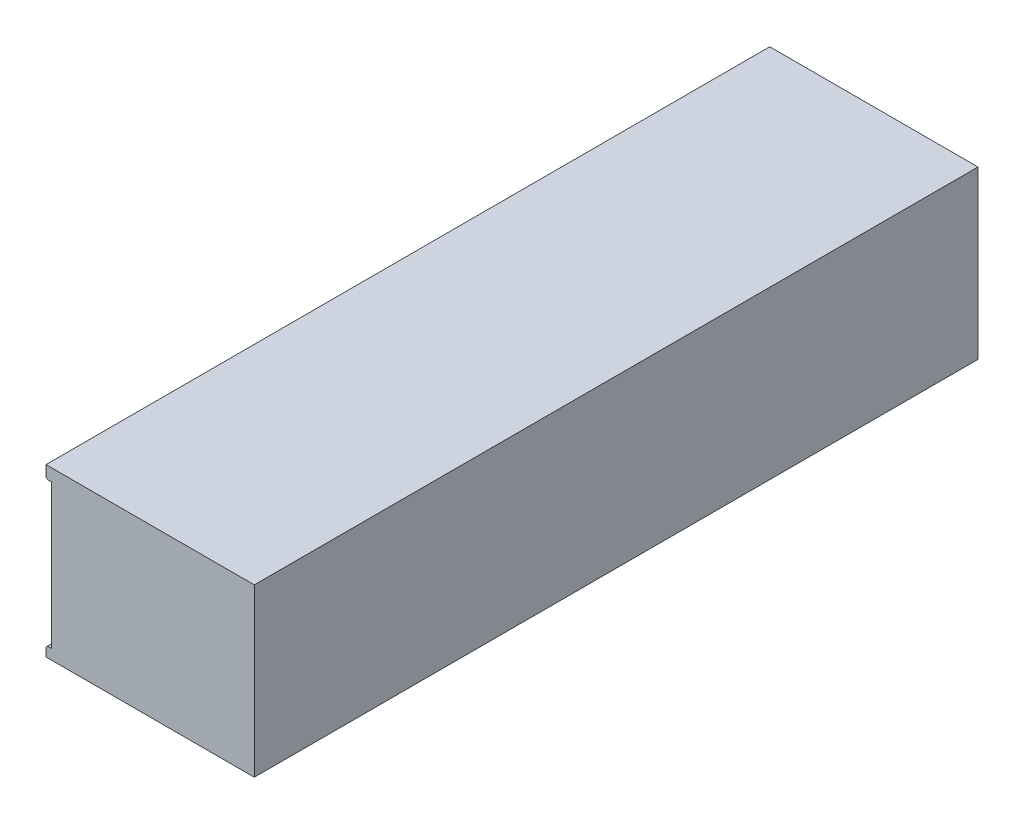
ISO-10303-21;
HEADER;
FILE_DESCRIPTION(('STEP AP214'),'2;1');
FILE_NAME('part.step','',(''),(''),'','','');
FILE_SCHEMA(('AUTOMOTIVE_DESIGN { 1 0 10303 214 1 1 1 1 }'));
ENDSEC;
DATA;
#1=APPLICATION_CONTEXT('core data for automotive mechanical design processes');
#2=APPLICATION_PROTOCOL_DEFINITION('international standard','automotive_design',2000,#1);
#3=PRODUCT_CONTEXT('',#1,'mechanical');
#4=PRODUCT('Part','Part','',(#3));
#5=PRODUCT_RELATED_PRODUCT_CATEGORY('part','',(#4));
#6=PRODUCT_DEFINITION_FORMATION('','',#4);
#7=PRODUCT_DEFINITION_CONTEXT('part definition',#1,'design');
#8=PRODUCT_DEFINITION('design','',#6,#7);
#9=PRODUCT_DEFINITION_SHAPE('','',#8);
#10=(LENGTH_UNIT() NAMED_UNIT(*) SI_UNIT(.MILLI.,.METRE.));
#11=(NAMED_UNIT(*) PLANE_ANGLE_UNIT() SI_UNIT($,.RADIAN.));
#12=(NAMED_UNIT(*) SI_UNIT($,.STERADIAN.) SOLID_ANGLE_UNIT());
#13=UNCERTAINTY_MEASURE_WITH_UNIT(LENGTH_MEASURE(1.E-05),#10,'distance_accuracy_value','');
#14=(GEOMETRIC_REPRESENTATION_CONTEXT(3) GLOBAL_UNCERTAINTY_ASSIGNED_CONTEXT((#13)) GLOBAL_UNIT_ASSIGNED_CONTEXT((#10,
#11,#12)) REPRESENTATION_CONTEXT('',''));
#15=CARTESIAN_POINT('',(0.,0.,0.));
#16=DIRECTION('',(0.,0.,1.));
#17=DIRECTION('',(1.,0.,0.));
#18=AXIS2_PLACEMENT_3D('',#15,#16,#17);
#19=CARTESIAN_POINT('',(-1.39699999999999,0.,90.4748));
#20=DIRECTION('',(0.,-1.,0.));
#21=DIRECTION('',(0.,0.,-1.));
#22=AXIS2_PLACEMENT_3D('',#19,#20,#21);
#23=PLANE('',#22);
#24=DIRECTION('',(-1.,0.,0.));
#25=VECTOR('',#24,1.);
#26=CARTESIAN_POINT('',(-1.39699999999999,0.,-90.4748));
#27=LINE('',#26,#25);
#28=CARTESIAN_POINT('',(50.673,0.,-90.4748));
#29=VERTEX_POINT('',#28);
#30=CARTESIAN_POINT('',(-1.39699999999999,0.,-90.4748));
#31=VERTEX_POINT('',#30);
#32=EDGE_CURVE('E240',#29,#31,#27,.T.);
#33=ORIENTED_EDGE('',*,*,#32,.T.);
#34=DIRECTION('',(0.,0.,-1.));
#35=VECTOR('',#34,1.);
#36=CARTESIAN_POINT('',(-1.39699999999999,0.,90.4748));
#37=LINE('',#36,#35);
#38=CARTESIAN_POINT('',(-1.39699999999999,0.,90.4748));
#39=VERTEX_POINT('',#38);
#40=EDGE_CURVE('E291',#39,#31,#37,.T.);
#41=ORIENTED_EDGE('',*,*,#40,.F.);
#42=DIRECTION('',(-1.,0.,0.));
#43=VECTOR('',#42,1.);
#44=CARTESIAN_POINT('',(-1.39699999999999,0.,90.4748));
#45=LINE('',#44,#43);
#46=CARTESIAN_POINT('',(50.673,0.,90.4748));
#47=VERTEX_POINT('',#46);
#48=EDGE_CURVE('E241',#47,#39,#45,.T.);
#49=ORIENTED_EDGE('',*,*,#48,.F.);
#50=DIRECTION('',(0.,0.,-1.));
#51=VECTOR('',#50,1.);
#52=CARTESIAN_POINT('',(50.673,0.,90.4748));
#53=LINE('',#52,#51);
#54=EDGE_CURVE('E260',#47,#29,#53,.T.);
#55=ORIENTED_EDGE('',*,*,#54,.T.);
#56=EDGE_LOOP('',(#33,#41,#49,#55));
#57=FACE_BOUND('',#56,.T.);
#58=ADVANCED_FACE('F37',(#57),#23,.F.);
#59=CARTESIAN_POINT('',(-1.39699999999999,-3.048,90.4748));
#60=DIRECTION('',(1.,0.,0.));
#61=DIRECTION('',(0.,0.,-1.));
#62=AXIS2_PLACEMENT_3D('',#59,#60,#61);
#63=PLANE('',#62);
#64=DIRECTION('',(0.,-1.,0.));
#65=VECTOR('',#64,1.);
#66=CARTESIAN_POINT('',(-1.39699999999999,-3.048,-90.4748));
#67=LINE('',#66,#65);
#68=CARTESIAN_POINT('',(-1.39699999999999,-2.66700000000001,-90.4748));
#69=VERTEX_POINT('',#68);
#70=EDGE_CURVE('E263',#31,#69,#67,.T.);
#71=ORIENTED_EDGE('',*,*,#70,.T.);
#72=DIRECTION('',(0.,0.,1.));
#73=VECTOR('',#72,1.);
#74=CARTESIAN_POINT('',(-1.39699999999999,-2.66700000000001,90.4748));
#75=LINE('',#74,#73);
#76=CARTESIAN_POINT('',(-1.39699999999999,-2.66700000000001,90.4748));
#77=VERTEX_POINT('',#76);
#78=EDGE_CURVE('E11',#69,#77,#75,.T.);
#79=ORIENTED_EDGE('',*,*,#78,.T.);
#80=DIRECTION('',(0.,-1.,0.));
#81=VECTOR('',#80,1.);
#82=CARTESIAN_POINT('',(-1.39699999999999,-3.048,90.4748));
#83=LINE('',#82,#81);
#84=EDGE_CURVE('E244',#39,#77,#83,.T.);
#85=ORIENTED_EDGE('',*,*,#84,.F.);
#86=ORIENTED_EDGE('',*,*,#40,.T.);
#87=EDGE_LOOP('',(#71,#79,#85,#86));
#88=FACE_BOUND('',#87,.T.);
#89=ADVANCED_FACE('F347',(#88),#63,.F.);
#90=CARTESIAN_POINT('',(0.,-3.048,90.4748));
#91=DIRECTION('',(0.,1.,0.));
#92=DIRECTION('',(0.,0.,1.));
#93=AXIS2_PLACEMENT_3D('',#90,#91,#92);
#94=PLANE('',#93);
#95=DIRECTION('',(1.,0.,0.));
#96=VECTOR('',#95,1.);
#97=CARTESIAN_POINT('',(0.,-3.048,90.4748));
#98=LINE('',#97,#96);
#99=CARTESIAN_POINT('',(-1.016,-3.048,90.4748));
#100=VERTEX_POINT('',#99);
#101=CARTESIAN_POINT('',(0.,-3.048,90.4748));
#102=VERTEX_POINT('',#101);
#103=EDGE_CURVE('E247',#100,#102,#98,.T.);
#104=ORIENTED_EDGE('',*,*,#103,.F.);
#105=DIRECTION('',(0.,0.,-1.));
#106=VECTOR('',#105,1.);
#107=CARTESIAN_POINT('',(-1.016,-3.048,90.4748));
#108=LINE('',#107,#106);
#109=CARTESIAN_POINT('',(-1.016,-3.048,-90.4748));
#110=VERTEX_POINT('',#109);
#111=EDGE_CURVE('E45',#100,#110,#108,.T.);
#112=ORIENTED_EDGE('',*,*,#111,.T.);
#113=DIRECTION('',(1.,0.,0.));
#114=VECTOR('',#113,1.);
#115=CARTESIAN_POINT('',(0.,-3.048,-90.4748));
#116=LINE('',#115,#114);
#117=CARTESIAN_POINT('',(0.,-3.048,-90.4748));
#118=VERTEX_POINT('',#117);
#119=EDGE_CURVE('E265',#110,#118,#116,.T.);
#120=ORIENTED_EDGE('',*,*,#119,.T.);
#121=DIRECTION('',(0.,0.,-1.));
#122=VECTOR('',#121,1.);
#123=CARTESIAN_POINT('',(0.,-3.048,90.4748));
#124=LINE('',#123,#122);
#125=EDGE_CURVE('E288',#102,#118,#124,.T.);
#126=ORIENTED_EDGE('',*,*,#125,.F.);
#127=EDGE_LOOP('',(#104,#112,#120,#126));
#128=FACE_BOUND('',#127,.T.);
#129=ADVANCED_FACE('F309',(#128),#94,.F.);
#130=CARTESIAN_POINT('',(0.,-39.116,90.4748));
#131=DIRECTION('',(1.,0.,0.));
#132=DIRECTION('',(0.,0.,-1.));
#133=AXIS2_PLACEMENT_3D('',#130,#131,#132);
#134=PLANE('',#133);
#135=CARTESIAN_POINT('',(0.,-6.34999999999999,-85.598));
#136=DIRECTION('',(-1.,0.,0.));
#137=DIRECTION('',(0.,0.,1.));
#138=AXIS2_PLACEMENT_3D('',#135,#136,#137);
#139=CIRCLE('',#138,2.413);
#140=CARTESIAN_POINT('',(0.,-6.34999999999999,-83.185));
#141=VERTEX_POINT('',#140);
#142=EDGE_CURVE('E153',#141,#141,#139,.T.);
#143=ORIENTED_EDGE('',*,*,#142,.F.);
#144=EDGE_LOOP('',(#143));
#145=FACE_BOUND('',#144,.T.);
#146=CARTESIAN_POINT('',(0.,-6.34999999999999,85.598));
#147=DIRECTION('',(-1.,0.,0.));
#148=DIRECTION('',(0.,0.,1.));
#149=AXIS2_PLACEMENT_3D('',#146,#147,#148);
#150=CIRCLE('',#149,2.413);
#151=CARTESIAN_POINT('',(0.,-6.34999999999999,88.011));
#152=VERTEX_POINT('',#151);
#153=EDGE_CURVE('E165',#152,#152,#150,.T.);
#154=ORIENTED_EDGE('',*,*,#153,.F.);
#155=EDGE_LOOP('',(#154));
#156=FACE_BOUND('',#155,.T.);
#157=CARTESIAN_POINT('',(0.,-6.34999999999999,4.8768));
#158=DIRECTION('',(-1.,0.,0.));
#159=DIRECTION('',(0.,0.,1.));
#160=AXIS2_PLACEMENT_3D('',#157,#158,#159);
#161=CIRCLE('',#160,2.413);
#162=CARTESIAN_POINT('',(0.,-6.34999999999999,7.2898));
#163=VERTEX_POINT('',#162);
#164=EDGE_CURVE('E177',#163,#163,#161,.T.);
#165=ORIENTED_EDGE('',*,*,#164,.F.);
#166=EDGE_LOOP('',(#165));
#167=FACE_BOUND('',#166,.T.);
#168=CARTESIAN_POINT('',(0.,-6.34999999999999,-4.8768));
#169=DIRECTION('',(-1.,0.,0.));
#170=DIRECTION('',(0.,0.,1.));
#171=AXIS2_PLACEMENT_3D('',#168,#169,#170);
#172=CIRCLE('',#171,2.413);
#173=CARTESIAN_POINT('',(0.,-6.34999999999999,-2.4638));
#174=VERTEX_POINT('',#173);
#175=EDGE_CURVE('E189',#174,#174,#172,.T.);
#176=ORIENTED_EDGE('',*,*,#175,.F.);
#177=EDGE_LOOP('',(#176));
#178=FACE_BOUND('',#177,.T.);
#179=CARTESIAN_POINT('',(0.,-35.814,-85.598));
#180=DIRECTION('',(-1.,0.,0.));
#181=DIRECTION('',(0.,0.,1.));
#182=AXIS2_PLACEMENT_3D('',#179,#180,#181);
#183=CIRCLE('',#182,2.413);
#184=CARTESIAN_POINT('',(0.,-35.814,-83.185));
#185=VERTEX_POINT('',#184);
#186=EDGE_CURVE('E201',#185,#185,#183,.T.);
#187=ORIENTED_EDGE('',*,*,#186,.F.);
#188=EDGE_LOOP('',(#187));
#189=FACE_BOUND('',#188,.T.);
#190=CARTESIAN_POINT('',(0.,-35.814,-4.87679999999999));
#191=DIRECTION('',(-1.,0.,0.));
#192=DIRECTION('',(0.,0.,1.));
#193=AXIS2_PLACEMENT_3D('',#190,#191,#192);
#194=CIRCLE('',#193,2.413);
#195=CARTESIAN_POINT('',(0.,-35.814,-2.46379999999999));
#196=VERTEX_POINT('',#195);
#197=EDGE_CURVE('E213',#196,#196,#194,.T.);
#198=ORIENTED_EDGE('',*,*,#197,.F.);
#199=EDGE_LOOP('',(#198));
#200=FACE_BOUND('',#199,.T.);
#201=CARTESIAN_POINT('',(0.,-35.814,4.8768));
#202=DIRECTION('',(-1.,0.,0.));
#203=DIRECTION('',(0.,0.,1.));
#204=AXIS2_PLACEMENT_3D('',#201,#202,#203);
#205=CIRCLE('',#204,2.413);
#206=CARTESIAN_POINT('',(0.,-35.814,7.2898));
#207=VERTEX_POINT('',#206);
#208=EDGE_CURVE('E225',#207,#207,#205,.T.);
#209=ORIENTED_EDGE('',*,*,#208,.F.);
#210=EDGE_LOOP('',(#209));
#211=FACE_BOUND('',#210,.T.);
#212=CARTESIAN_POINT('',(0.,-35.814,85.598));
#213=DIRECTION('',(-1.,0.,0.));
#214=DIRECTION('',(0.,0.,1.));
#215=AXIS2_PLACEMENT_3D('',#212,#213,#214);
#216=CIRCLE('',#215,2.413);
#217=CARTESIAN_POINT('',(0.,-35.814,88.011));
#218=VERTEX_POINT('',#217);
#219=EDGE_CURVE('E237',#218,#218,#216,.T.);
#220=ORIENTED_EDGE('',*,*,#219,.F.);
#221=EDGE_LOOP('',(#220));
#222=FACE_BOUND('',#221,.T.);
#223=DIRECTION('',(0.,-1.,0.));
#224=VECTOR('',#223,1.);
#225=CARTESIAN_POINT('',(0.,-39.116,-90.4748));
#226=LINE('',#225,#224);
#227=CARTESIAN_POINT('',(0.,-39.116,-90.4748));
#228=VERTEX_POINT('',#227);
#229=EDGE_CURVE('E267',#118,#228,#226,.T.);
#230=ORIENTED_EDGE('',*,*,#229,.T.);
#231=DIRECTION('',(0.,0.,-1.));
#232=VECTOR('',#231,1.);
#233=CARTESIAN_POINT('',(0.,-39.116,90.4748));
#234=LINE('',#233,#232);
#235=CARTESIAN_POINT('',(0.,-39.116,90.4748));
#236=VERTEX_POINT('',#235);
#237=EDGE_CURVE('E285',#236,#228,#234,.T.);
#238=ORIENTED_EDGE('',*,*,#237,.F.);
#239=DIRECTION('',(0.,-1.,0.));
#240=VECTOR('',#239,1.);
#241=CARTESIAN_POINT('',(0.,-39.116,90.4748));
#242=LINE('',#241,#240);
#243=EDGE_CURVE('E249',#102,#236,#242,.T.);
#244=ORIENTED_EDGE('',*,*,#243,.F.);
#245=ORIENTED_EDGE('',*,*,#125,.T.);
#246=EDGE_LOOP('',(#230,#238,#244,#245));
#247=FACE_BOUND('',#246,.T.);
#248=ADVANCED_FACE('F319',(#145,#156,#167,#178,#189,#200,#211,#222,#247),#134,.F.);
#249=CARTESIAN_POINT('',(-1.39699999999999,-39.116,90.4748));
#250=DIRECTION('',(0.,-1.,0.));
#251=DIRECTION('',(0.,0.,-1.));
#252=AXIS2_PLACEMENT_3D('',#249,#250,#251);
#253=PLANE('',#252);
#254=DIRECTION('',(-1.,0.,0.));
#255=VECTOR('',#254,1.);
#256=CARTESIAN_POINT('',(-1.39699999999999,-39.116,-90.4748));
#257=LINE('',#256,#255);
#258=CARTESIAN_POINT('',(-1.016,-39.116,-90.4748));
#259=VERTEX_POINT('',#258);
#260=EDGE_CURVE('E269',#228,#259,#257,.T.);
#261=ORIENTED_EDGE('',*,*,#260,.T.);
#262=DIRECTION('',(0.,0.,1.));
#263=VECTOR('',#262,1.);
#264=CARTESIAN_POINT('',(-1.016,-39.116,90.4748));
#265=LINE('',#264,#263);
#266=CARTESIAN_POINT('',(-1.016,-39.116,90.4748));
#267=VERTEX_POINT('',#266);
#268=EDGE_CURVE('E301',#259,#267,#265,.T.);
#269=ORIENTED_EDGE('',*,*,#268,.T.);
#270=DIRECTION('',(-1.,0.,0.));
#271=VECTOR('',#270,1.);
#272=CARTESIAN_POINT('',(-1.39699999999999,-39.116,90.4748));
#273=LINE('',#272,#271);
#274=EDGE_CURVE('E251',#236,#267,#273,.T.);
#275=ORIENTED_EDGE('',*,*,#274,.F.);
#276=ORIENTED_EDGE('',*,*,#237,.T.);
#277=EDGE_LOOP('',(#261,#269,#275,#276));
#278=FACE_BOUND('',#277,.T.);
#279=ADVANCED_FACE('F323',(#278),#253,.F.);
#280=CARTESIAN_POINT('',(-1.39699999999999,-41.656,90.4748));
#281=DIRECTION('',(1.,0.,0.));
#282=DIRECTION('',(0.,0.,-1.));
#283=AXIS2_PLACEMENT_3D('',#280,#281,#282);
#284=PLANE('',#283);
#285=DIRECTION('',(0.,-1.,0.));
#286=VECTOR('',#285,1.);
#287=CARTESIAN_POINT('',(-1.39699999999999,-41.656,90.4748));
#288=LINE('',#287,#286);
#289=CARTESIAN_POINT('',(-1.39699999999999,-39.497,90.4748));
#290=VERTEX_POINT('',#289);
#291=CARTESIAN_POINT('',(-1.39699999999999,-41.656,90.4748));
#292=VERTEX_POINT('',#291);
#293=EDGE_CURVE('E254',#290,#292,#288,.T.);
#294=ORIENTED_EDGE('',*,*,#293,.F.);
#295=DIRECTION('',(0.,0.,-1.));
#296=VECTOR('',#295,1.);
#297=CARTESIAN_POINT('',(-1.39699999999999,-39.497,90.4748));
#298=LINE('',#297,#296);
#299=CARTESIAN_POINT('',(-1.39699999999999,-39.497,-90.4748));
#300=VERTEX_POINT('',#299);
#301=EDGE_CURVE('E294',#290,#300,#298,.T.);
#302=ORIENTED_EDGE('',*,*,#301,.T.);
#303=DIRECTION('',(0.,-1.,0.));
#304=VECTOR('',#303,1.);
#305=CARTESIAN_POINT('',(-1.39699999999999,-41.656,-90.4748));
#306=LINE('',#305,#304);
#307=CARTESIAN_POINT('',(-1.39699999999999,-41.656,-90.4748));
#308=VERTEX_POINT('',#307);
#309=EDGE_CURVE('E272',#300,#308,#306,.T.);
#310=ORIENTED_EDGE('',*,*,#309,.T.);
#311=DIRECTION('',(0.,0.,-1.));
#312=VECTOR('',#311,1.);
#313=CARTESIAN_POINT('',(-1.39699999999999,-41.656,90.4748));
#314=LINE('',#313,#312);
#315=EDGE_CURVE('E282',#292,#308,#314,.T.);
#316=ORIENTED_EDGE('',*,*,#315,.F.);
#317=EDGE_LOOP('',(#294,#302,#310,#316));
#318=FACE_BOUND('',#317,.T.);
#319=ADVANCED_FACE('F331',(#318),#284,.F.);
#320=CARTESIAN_POINT('',(50.673,-41.656,90.4748));
#321=DIRECTION('',(0.,1.,0.));
#322=DIRECTION('',(-1.,0.,0.));
#323=AXIS2_PLACEMENT_3D('',#320,#321,#322);
#324=PLANE('',#323);
#325=DIRECTION('',(1.,0.,0.));
#326=VECTOR('',#325,1.);
#327=CARTESIAN_POINT('',(50.673,-41.656,-90.4748));
#328=LINE('',#327,#326);
#329=CARTESIAN_POINT('',(50.673,-41.656,-90.4748));
#330=VERTEX_POINT('',#329);
#331=EDGE_CURVE('E274',#308,#330,#328,.T.);
#332=ORIENTED_EDGE('',*,*,#331,.T.);
#333=DIRECTION('',(0.,0.,-1.));
#334=VECTOR('',#333,1.);
#335=CARTESIAN_POINT('',(50.673,-41.656,90.4748));
#336=LINE('',#335,#334);
#337=CARTESIAN_POINT('',(50.673,-41.656,90.4748));
#338=VERTEX_POINT('',#337);
#339=EDGE_CURVE('E279',#338,#330,#336,.T.);
#340=ORIENTED_EDGE('',*,*,#339,.F.);
#341=DIRECTION('',(1.,0.,0.));
#342=VECTOR('',#341,1.);
#343=CARTESIAN_POINT('',(50.673,-41.656,90.4748));
#344=LINE('',#343,#342);
#345=EDGE_CURVE('E256',#292,#338,#344,.T.);
#346=ORIENTED_EDGE('',*,*,#345,.F.);
#347=ORIENTED_EDGE('',*,*,#315,.T.);
#348=EDGE_LOOP('',(#332,#340,#346,#347));
#349=FACE_BOUND('',#348,.T.);
#350=ADVANCED_FACE('F338',(#349),#324,.F.);
#351=CARTESIAN_POINT('',(50.673,0.,90.4748));
#352=DIRECTION('',(-1.,0.,0.));
#353=DIRECTION('',(0.,-1.,0.));
#354=AXIS2_PLACEMENT_3D('',#351,#352,#353);
#355=PLANE('',#354);
#356=DIRECTION('',(0.,1.,0.));
#357=VECTOR('',#356,1.);
#358=CARTESIAN_POINT('',(50.673,0.,-90.4748));
#359=LINE('',#358,#357);
#360=EDGE_CURVE('E245',#330,#29,#359,.T.);
#361=ORIENTED_EDGE('',*,*,#360,.T.);
#362=ORIENTED_EDGE('',*,*,#54,.F.);
#363=DIRECTION('',(0.,1.,0.));
#364=VECTOR('',#363,1.);
#365=CARTESIAN_POINT('',(50.673,0.,90.4748));
#366=LINE('',#365,#364);
#367=EDGE_CURVE('E258',#338,#47,#366,.T.);
#368=ORIENTED_EDGE('',*,*,#367,.F.);
#369=ORIENTED_EDGE('',*,*,#339,.T.);
#370=EDGE_LOOP('',(#361,#362,#368,#369));
#371=FACE_BOUND('',#370,.T.);
#372=ADVANCED_FACE('F342',(#371),#355,.F.);
#373=CARTESIAN_POINT('',(-1.39699999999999,0.,90.4748));
#374=DIRECTION('',(0.,0.,1.));
#375=DIRECTION('',(1.,0.,0.));
#376=AXIS2_PLACEMENT_3D('',#373,#374,#375);
#377=PLANE('',#376);
#378=ORIENTED_EDGE('',*,*,#274,.T.);
#379=DIRECTION('',(0.707106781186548,0.707106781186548,0.));
#380=VECTOR('',#379,1.);
#381=CARTESIAN_POINT('',(18.3515,-19.7485,90.4748));
#382=LINE('',#381,#380);
#383=EDGE_CURVE('E304',#267,#290,#382,.F.);
#384=ORIENTED_EDGE('',*,*,#383,.T.);
#385=ORIENTED_EDGE('',*,*,#293,.T.);
#386=ORIENTED_EDGE('',*,*,#345,.T.);
#387=ORIENTED_EDGE('',*,*,#367,.T.);
#388=ORIENTED_EDGE('',*,*,#48,.T.);
#389=ORIENTED_EDGE('',*,*,#84,.T.);
#390=DIRECTION('',(-0.707106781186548,0.707106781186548,0.));
#391=VECTOR('',#390,1.);
#392=CARTESIAN_POINT('',(-2.73049999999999,-1.3335,90.4748));
#393=LINE('',#392,#391);
#394=EDGE_CURVE('E52',#77,#100,#393,.F.);
#395=ORIENTED_EDGE('',*,*,#394,.T.);
#396=ORIENTED_EDGE('',*,*,#103,.T.);
#397=ORIENTED_EDGE('',*,*,#243,.T.);
#398=EDGE_LOOP('',(#378,#384,#385,#386,#387,#388,#389,#395,#396,#397));
#399=FACE_BOUND('',#398,.T.);
#400=ADVANCED_FACE('F326',(#399),#377,.T.);
#401=CARTESIAN_POINT('',(-1.39699999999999,0.,-90.4748));
#402=DIRECTION('',(0.,0.,1.));
#403=DIRECTION('',(1.,0.,0.));
#404=AXIS2_PLACEMENT_3D('',#401,#402,#403);
#405=PLANE('',#404);
#406=ORIENTED_EDGE('',*,*,#309,.F.);
#407=DIRECTION('',(-0.707106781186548,-0.707106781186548,0.));
#408=VECTOR('',#407,1.);
#409=CARTESIAN_POINT('',(-1.39699999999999,-39.497,-90.4748));
#410=LINE('',#409,#408);
#411=EDGE_CURVE('E299',#300,#259,#410,.F.);
#412=ORIENTED_EDGE('',*,*,#411,.T.);
#413=ORIENTED_EDGE('',*,*,#260,.F.);
#414=ORIENTED_EDGE('',*,*,#229,.F.);
#415=ORIENTED_EDGE('',*,*,#119,.F.);
#416=DIRECTION('',(0.707106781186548,-0.707106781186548,0.));
#417=VECTOR('',#416,1.);
#418=CARTESIAN_POINT('',(-1.016,-3.048,-90.4748));
#419=LINE('',#418,#417);
#420=EDGE_CURVE('E297',#110,#69,#419,.F.);
#421=ORIENTED_EDGE('',*,*,#420,.T.);
#422=ORIENTED_EDGE('',*,*,#70,.F.);
#423=ORIENTED_EDGE('',*,*,#32,.F.);
#424=ORIENTED_EDGE('',*,*,#360,.F.);
#425=ORIENTED_EDGE('',*,*,#331,.F.);
#426=EDGE_LOOP('',(#406,#412,#413,#414,#415,#421,#422,#423,#424,#425));
#427=FACE_BOUND('',#426,.T.);
#428=ADVANCED_FACE('F315',(#427),#405,.F.);
#429=CARTESIAN_POINT('',(0.,-35.814,85.598));
#430=DIRECTION('',(-1.,0.,0.));
#431=DIRECTION('',(0.,0.,1.));
#432=AXIS2_PLACEMENT_3D('',#429,#430,#431);
#433=CYLINDRICAL_SURFACE('',#432,2.413);
#434=CARTESIAN_POINT('',(7.62,-35.814,85.598));
#435=DIRECTION('',(-1.,0.,0.));
#436=DIRECTION('',(0.,0.,1.));
#437=AXIS2_PLACEMENT_3D('',#434,#435,#436);
#438=CIRCLE('',#437,2.413);
#439=CARTESIAN_POINT('',(7.62,-35.814,88.011));
#440=VERTEX_POINT('',#439);
#441=EDGE_CURVE('E234',#440,#440,#438,.T.);
#442=ORIENTED_EDGE('',*,*,#441,.F.);
#443=EDGE_LOOP('',(#442));
#444=FACE_BOUND('',#443,.T.);
#445=ORIENTED_EDGE('',*,*,#219,.T.);
#446=EDGE_LOOP('',(#445));
#447=FACE_BOUND('',#446,.T.);
#448=ADVANCED_FACE('F374',(#444,#447),#433,.F.);
#449=CARTESIAN_POINT('',(7.62,-33.7947,85.598));
#450=DIRECTION('',(1.,0.,0.));
#451=DIRECTION('',(0.,0.,-1.));
#452=AXIS2_PLACEMENT_3D('',#449,#450,#451);
#453=PLANE('',#452);
#454=CARTESIAN_POINT('',(7.62,-35.814,85.598));
#455=DIRECTION('',(-1.,0.,0.));
#456=DIRECTION('',(0.,0.,1.));
#457=AXIS2_PLACEMENT_3D('',#454,#455,#456);
#458=CIRCLE('',#457,2.0193);
#459=CARTESIAN_POINT('',(7.62,-35.814,87.6173));
#460=VERTEX_POINT('',#459);
#461=EDGE_CURVE('E231',#460,#460,#458,.T.);
#462=ORIENTED_EDGE('',*,*,#461,.F.);
#463=EDGE_LOOP('',(#462));
#464=FACE_BOUND('',#463,.T.);
#465=ORIENTED_EDGE('',*,*,#441,.T.);
#466=EDGE_LOOP('',(#465));
#467=FACE_BOUND('',#466,.T.);
#468=ADVANCED_FACE('F379',(#464,#467),#453,.F.);
#469=CARTESIAN_POINT('',(0.,-35.814,85.598));
#470=DIRECTION('',(-1.,0.,0.));
#471=DIRECTION('',(0.,0.,1.));
#472=AXIS2_PLACEMENT_3D('',#469,#470,#471);
#473=CYLINDRICAL_SURFACE('',#472,2.0193);
#474=CARTESIAN_POINT('',(9.99744,-35.814,85.598));
#475=DIRECTION('',(-1.,0.,0.));
#476=DIRECTION('',(0.,0.,1.));
#477=AXIS2_PLACEMENT_3D('',#474,#475,#476);
#478=CIRCLE('',#477,2.01929999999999);
#479=CARTESIAN_POINT('',(9.99744,-35.814,87.6173));
#480=VERTEX_POINT('',#479);
#481=EDGE_CURVE('E228',#480,#480,#478,.T.);
#482=ORIENTED_EDGE('',*,*,#481,.F.);
#483=EDGE_LOOP('',(#482));
#484=FACE_BOUND('',#483,.T.);
#485=ORIENTED_EDGE('',*,*,#461,.T.);
#486=EDGE_LOOP('',(#485));
#487=FACE_BOUND('',#486,.T.);
#488=ADVANCED_FACE('F383',(#484,#487),#473,.F.);
#489=CARTESIAN_POINT('',(9.99744,-35.814,85.598));
#490=DIRECTION('',(-1.,0.,0.));
#491=DIRECTION('',(0.,0.,1.));
#492=AXIS2_PLACEMENT_3D('',#489,#490,#491);
#493=CONICAL_SURFACE('',#492,2.01929999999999,1.02974425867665);
#494=CARTESIAN_POINT('',(11.2107578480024,-35.814,85.598));
#495=VERTEX_POINT('',#494);
#496=VERTEX_LOOP('',#495);
#497=FACE_BOUND('',#496,.T.);
#498=ORIENTED_EDGE('',*,*,#481,.T.);
#499=EDGE_LOOP('',(#498));
#500=FACE_BOUND('',#499,.T.);
#501=ADVANCED_FACE('F387',(#497,#500),#493,.F.);
#502=CARTESIAN_POINT('',(0.,-35.814,4.8768));
#503=DIRECTION('',(-1.,0.,0.));
#504=DIRECTION('',(0.,0.,1.));
#505=AXIS2_PLACEMENT_3D('',#502,#503,#504);
#506=CYLINDRICAL_SURFACE('',#505,2.413);
#507=CARTESIAN_POINT('',(7.62,-35.814,4.8768));
#508=DIRECTION('',(-1.,0.,0.));
#509=DIRECTION('',(0.,0.,1.));
#510=AXIS2_PLACEMENT_3D('',#507,#508,#509);
#511=CIRCLE('',#510,2.413);
#512=CARTESIAN_POINT('',(7.62,-35.814,7.2898));
#513=VERTEX_POINT('',#512);
#514=EDGE_CURVE('E222',#513,#513,#511,.T.);
#515=ORIENTED_EDGE('',*,*,#514,.F.);
#516=EDGE_LOOP('',(#515));
#517=FACE_BOUND('',#516,.T.);
#518=ORIENTED_EDGE('',*,*,#208,.T.);
#519=EDGE_LOOP('',(#518));
#520=FACE_BOUND('',#519,.T.);
#521=ADVANCED_FACE('F391',(#517,#520),#506,.F.);
#522=CARTESIAN_POINT('',(7.62,-33.7947,4.8768));
#523=DIRECTION('',(1.,0.,0.));
#524=DIRECTION('',(0.,0.,-1.));
#525=AXIS2_PLACEMENT_3D('',#522,#523,#524);
#526=PLANE('',#525);
#527=CARTESIAN_POINT('',(7.62,-35.814,4.8768));
#528=DIRECTION('',(-1.,0.,0.));
#529=DIRECTION('',(0.,0.,1.));
#530=AXIS2_PLACEMENT_3D('',#527,#528,#529);
#531=CIRCLE('',#530,2.0193);
#532=CARTESIAN_POINT('',(7.62,-35.814,6.8961));
#533=VERTEX_POINT('',#532);
#534=EDGE_CURVE('E219',#533,#533,#531,.T.);
#535=ORIENTED_EDGE('',*,*,#534,.F.);
#536=EDGE_LOOP('',(#535));
#537=FACE_BOUND('',#536,.T.);
#538=ORIENTED_EDGE('',*,*,#514,.T.);
#539=EDGE_LOOP('',(#538));
#540=FACE_BOUND('',#539,.T.);
#541=ADVANCED_FACE('F395',(#537,#540),#526,.F.);
#542=CARTESIAN_POINT('',(0.,-35.814,4.8768));
#543=DIRECTION('',(-1.,0.,0.));
#544=DIRECTION('',(0.,0.,1.));
#545=AXIS2_PLACEMENT_3D('',#542,#543,#544);
#546=CYLINDRICAL_SURFACE('',#545,2.0193);
#547=CARTESIAN_POINT('',(9.99744,-35.814,4.8768));
#548=DIRECTION('',(-1.,0.,0.));
#549=DIRECTION('',(0.,0.,1.));
#550=AXIS2_PLACEMENT_3D('',#547,#548,#549);
#551=CIRCLE('',#550,2.01929999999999);
#552=CARTESIAN_POINT('',(9.99744,-35.814,6.8961));
#553=VERTEX_POINT('',#552);
#554=EDGE_CURVE('E216',#553,#553,#551,.T.);
#555=ORIENTED_EDGE('',*,*,#554,.F.);
#556=EDGE_LOOP('',(#555));
#557=FACE_BOUND('',#556,.T.);
#558=ORIENTED_EDGE('',*,*,#534,.T.);
#559=EDGE_LOOP('',(#558));
#560=FACE_BOUND('',#559,.T.);
#561=ADVANCED_FACE('F399',(#557,#560),#546,.F.);
#562=CARTESIAN_POINT('',(9.99744,-35.814,4.8768));
#563=DIRECTION('',(-1.,0.,0.));
#564=DIRECTION('',(0.,0.,1.));
#565=AXIS2_PLACEMENT_3D('',#562,#563,#564);
#566=CONICAL_SURFACE('',#565,2.01929999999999,1.02974425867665);
#567=CARTESIAN_POINT('',(11.2107578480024,-35.814,4.8768));
#568=VERTEX_POINT('',#567);
#569=VERTEX_LOOP('',#568);
#570=FACE_BOUND('',#569,.T.);
#571=ORIENTED_EDGE('',*,*,#554,.T.);
#572=EDGE_LOOP('',(#571));
#573=FACE_BOUND('',#572,.T.);
#574=ADVANCED_FACE('F403',(#570,#573),#566,.F.);
#575=CARTESIAN_POINT('',(0.,-35.814,-4.87679999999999));
#576=DIRECTION('',(-1.,0.,0.));
#577=DIRECTION('',(0.,0.,1.));
#578=AXIS2_PLACEMENT_3D('',#575,#576,#577);
#579=CYLINDRICAL_SURFACE('',#578,2.413);
#580=CARTESIAN_POINT('',(7.62,-35.814,-4.87679999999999));
#581=DIRECTION('',(-1.,0.,0.));
#582=DIRECTION('',(0.,0.,1.));
#583=AXIS2_PLACEMENT_3D('',#580,#581,#582);
#584=CIRCLE('',#583,2.413);
#585=CARTESIAN_POINT('',(7.62,-35.814,-2.46379999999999));
#586=VERTEX_POINT('',#585);
#587=EDGE_CURVE('E210',#586,#586,#584,.T.);
#588=ORIENTED_EDGE('',*,*,#587,.F.);
#589=EDGE_LOOP('',(#588));
#590=FACE_BOUND('',#589,.T.);
#591=ORIENTED_EDGE('',*,*,#197,.T.);
#592=EDGE_LOOP('',(#591));
#593=FACE_BOUND('',#592,.T.);
#594=ADVANCED_FACE('F407',(#590,#593),#579,.F.);
#595=CARTESIAN_POINT('',(7.62,-33.7947,-4.87679999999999));
#596=DIRECTION('',(1.,0.,0.));
#597=DIRECTION('',(0.,0.,-1.));
#598=AXIS2_PLACEMENT_3D('',#595,#596,#597);
#599=PLANE('',#598);
#600=CARTESIAN_POINT('',(7.62,-35.814,-4.87679999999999));
#601=DIRECTION('',(-1.,0.,0.));
#602=DIRECTION('',(0.,0.,1.));
#603=AXIS2_PLACEMENT_3D('',#600,#601,#602);
#604=CIRCLE('',#603,2.0193);
#605=CARTESIAN_POINT('',(7.62,-35.814,-2.85749999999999));
#606=VERTEX_POINT('',#605);
#607=EDGE_CURVE('E207',#606,#606,#604,.T.);
#608=ORIENTED_EDGE('',*,*,#607,.F.);
#609=EDGE_LOOP('',(#608));
#610=FACE_BOUND('',#609,.T.);
#611=ORIENTED_EDGE('',*,*,#587,.T.);
#612=EDGE_LOOP('',(#611));
#613=FACE_BOUND('',#612,.T.);
#614=ADVANCED_FACE('F411',(#610,#613),#599,.F.);
#615=CARTESIAN_POINT('',(0.,-35.814,-4.87679999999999));
#616=DIRECTION('',(-1.,0.,0.));
#617=DIRECTION('',(0.,0.,1.));
#618=AXIS2_PLACEMENT_3D('',#615,#616,#617);
#619=CYLINDRICAL_SURFACE('',#618,2.0193);
#620=CARTESIAN_POINT('',(9.99744,-35.814,-4.87679999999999));
#621=DIRECTION('',(-1.,0.,0.));
#622=DIRECTION('',(0.,0.,1.));
#623=AXIS2_PLACEMENT_3D('',#620,#621,#622);
#624=CIRCLE('',#623,2.01929999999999);
#625=CARTESIAN_POINT('',(9.99744,-35.814,-2.8575));
#626=VERTEX_POINT('',#625);
#627=EDGE_CURVE('E204',#626,#626,#624,.T.);
#628=ORIENTED_EDGE('',*,*,#627,.F.);
#629=EDGE_LOOP('',(#628));
#630=FACE_BOUND('',#629,.T.);
#631=ORIENTED_EDGE('',*,*,#607,.T.);
#632=EDGE_LOOP('',(#631));
#633=FACE_BOUND('',#632,.T.);
#634=ADVANCED_FACE('F415',(#630,#633),#619,.F.);
#635=CARTESIAN_POINT('',(9.99744,-35.814,-4.87679999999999));
#636=DIRECTION('',(-1.,0.,0.));
#637=DIRECTION('',(0.,0.,1.));
#638=AXIS2_PLACEMENT_3D('',#635,#636,#637);
#639=CONICAL_SURFACE('',#638,2.01929999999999,1.02974425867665);
#640=CARTESIAN_POINT('',(11.2107578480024,-35.814,-4.87679999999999));
#641=VERTEX_POINT('',#640);
#642=VERTEX_LOOP('',#641);
#643=FACE_BOUND('',#642,.T.);
#644=ORIENTED_EDGE('',*,*,#627,.T.);
#645=EDGE_LOOP('',(#644));
#646=FACE_BOUND('',#645,.T.);
#647=ADVANCED_FACE('F419',(#643,#646),#639,.F.);
#648=CARTESIAN_POINT('',(0.,-35.814,-85.598));
#649=DIRECTION('',(-1.,0.,0.));
#650=DIRECTION('',(0.,0.,1.));
#651=AXIS2_PLACEMENT_3D('',#648,#649,#650);
#652=CYLINDRICAL_SURFACE('',#651,2.413);
#653=CARTESIAN_POINT('',(7.61999999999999,-35.814,-85.598));
#654=DIRECTION('',(-1.,0.,0.));
#655=DIRECTION('',(0.,0.,1.));
#656=AXIS2_PLACEMENT_3D('',#653,#654,#655);
#657=CIRCLE('',#656,2.413);
#658=CARTESIAN_POINT('',(7.61999999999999,-35.814,-83.185));
#659=VERTEX_POINT('',#658);
#660=EDGE_CURVE('E198',#659,#659,#657,.T.);
#661=ORIENTED_EDGE('',*,*,#660,.F.);
#662=EDGE_LOOP('',(#661));
#663=FACE_BOUND('',#662,.T.);
#664=ORIENTED_EDGE('',*,*,#186,.T.);
#665=EDGE_LOOP('',(#664));
#666=FACE_BOUND('',#665,.T.);
#667=ADVANCED_FACE('F423',(#663,#666),#652,.F.);
#668=CARTESIAN_POINT('',(7.61999999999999,-33.7947,-85.598));
#669=DIRECTION('',(1.,0.,0.));
#670=DIRECTION('',(0.,0.,-1.));
#671=AXIS2_PLACEMENT_3D('',#668,#669,#670);
#672=PLANE('',#671);
#673=CARTESIAN_POINT('',(7.61999999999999,-35.814,-85.598));
#674=DIRECTION('',(-1.,0.,0.));
#675=DIRECTION('',(0.,0.,1.));
#676=AXIS2_PLACEMENT_3D('',#673,#674,#675);
#677=CIRCLE('',#676,2.0193);
#678=CARTESIAN_POINT('',(7.61999999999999,-35.814,-83.5787));
#679=VERTEX_POINT('',#678);
#680=EDGE_CURVE('E195',#679,#679,#677,.T.);
#681=ORIENTED_EDGE('',*,*,#680,.F.);
#682=EDGE_LOOP('',(#681));
#683=FACE_BOUND('',#682,.T.);
#684=ORIENTED_EDGE('',*,*,#660,.T.);
#685=EDGE_LOOP('',(#684));
#686=FACE_BOUND('',#685,.T.);
#687=ADVANCED_FACE('F427',(#683,#686),#672,.F.);
#688=CARTESIAN_POINT('',(0.,-35.814,-85.598));
#689=DIRECTION('',(-1.,0.,0.));
#690=DIRECTION('',(0.,0.,1.));
#691=AXIS2_PLACEMENT_3D('',#688,#689,#690);
#692=CYLINDRICAL_SURFACE('',#691,2.0193);
#693=CARTESIAN_POINT('',(9.99743999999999,-35.814,-85.598));
#694=DIRECTION('',(-1.,0.,0.));
#695=DIRECTION('',(0.,0.,1.));
#696=AXIS2_PLACEMENT_3D('',#693,#694,#695);
#697=CIRCLE('',#696,2.01929999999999);
#698=CARTESIAN_POINT('',(9.99743999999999,-35.814,-83.5787));
#699=VERTEX_POINT('',#698);
#700=EDGE_CURVE('E192',#699,#699,#697,.T.);
#701=ORIENTED_EDGE('',*,*,#700,.F.);
#702=EDGE_LOOP('',(#701));
#703=FACE_BOUND('',#702,.T.);
#704=ORIENTED_EDGE('',*,*,#680,.T.);
#705=EDGE_LOOP('',(#704));
#706=FACE_BOUND('',#705,.T.);
#707=ADVANCED_FACE('F431',(#703,#706),#692,.F.);
#708=CARTESIAN_POINT('',(9.99743999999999,-35.814,-85.598));
#709=DIRECTION('',(-1.,0.,0.));
#710=DIRECTION('',(0.,0.,1.));
#711=AXIS2_PLACEMENT_3D('',#708,#709,#710);
#712=CONICAL_SURFACE('',#711,2.01929999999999,1.02974425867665);
#713=CARTESIAN_POINT('',(11.2107578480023,-35.814,-85.598));
#714=VERTEX_POINT('',#713);
#715=VERTEX_LOOP('',#714);
#716=FACE_BOUND('',#715,.T.);
#717=ORIENTED_EDGE('',*,*,#700,.T.);
#718=EDGE_LOOP('',(#717));
#719=FACE_BOUND('',#718,.T.);
#720=ADVANCED_FACE('F435',(#716,#719),#712,.F.);
#721=CARTESIAN_POINT('',(0.,-6.34999999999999,-4.8768));
#722=DIRECTION('',(-1.,0.,0.));
#723=DIRECTION('',(0.,0.,1.));
#724=AXIS2_PLACEMENT_3D('',#721,#722,#723);
#725=CYLINDRICAL_SURFACE('',#724,2.413);
#726=CARTESIAN_POINT('',(7.62,-6.34999999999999,-4.8768));
#727=DIRECTION('',(-1.,0.,0.));
#728=DIRECTION('',(0.,0.,1.));
#729=AXIS2_PLACEMENT_3D('',#726,#727,#728);
#730=CIRCLE('',#729,2.413);
#731=CARTESIAN_POINT('',(7.62,-6.34999999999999,-2.4638));
#732=VERTEX_POINT('',#731);
#733=EDGE_CURVE('E186',#732,#732,#730,.T.);
#734=ORIENTED_EDGE('',*,*,#733,.F.);
#735=EDGE_LOOP('',(#734));
#736=FACE_BOUND('',#735,.T.);
#737=ORIENTED_EDGE('',*,*,#175,.T.);
#738=EDGE_LOOP('',(#737));
#739=FACE_BOUND('',#738,.T.);
#740=ADVANCED_FACE('F439',(#736,#739),#725,.F.);
#741=CARTESIAN_POINT('',(7.62,-4.33069999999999,-4.8768));
#742=DIRECTION('',(1.,0.,0.));
#743=DIRECTION('',(0.,0.,-1.));
#744=AXIS2_PLACEMENT_3D('',#741,#742,#743);
#745=PLANE('',#744);
#746=CARTESIAN_POINT('',(7.62,-6.34999999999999,-4.8768));
#747=DIRECTION('',(-1.,0.,0.));
#748=DIRECTION('',(0.,0.,1.));
#749=AXIS2_PLACEMENT_3D('',#746,#747,#748);
#750=CIRCLE('',#749,2.0193);
#751=CARTESIAN_POINT('',(7.62,-6.34999999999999,-2.8575));
#752=VERTEX_POINT('',#751);
#753=EDGE_CURVE('E183',#752,#752,#750,.T.);
#754=ORIENTED_EDGE('',*,*,#753,.F.);
#755=EDGE_LOOP('',(#754));
#756=FACE_BOUND('',#755,.T.);
#757=ORIENTED_EDGE('',*,*,#733,.T.);
#758=EDGE_LOOP('',(#757));
#759=FACE_BOUND('',#758,.T.);
#760=ADVANCED_FACE('F443',(#756,#759),#745,.F.);
#761=CARTESIAN_POINT('',(0.,-6.34999999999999,-4.8768));
#762=DIRECTION('',(-1.,0.,0.));
#763=DIRECTION('',(0.,0.,1.));
#764=AXIS2_PLACEMENT_3D('',#761,#762,#763);
#765=CYLINDRICAL_SURFACE('',#764,2.0193);
#766=CARTESIAN_POINT('',(9.99744,-6.34999999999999,-4.8768));
#767=DIRECTION('',(-1.,0.,0.));
#768=DIRECTION('',(0.,0.,1.));
#769=AXIS2_PLACEMENT_3D('',#766,#767,#768);
#770=CIRCLE('',#769,2.0193);
#771=CARTESIAN_POINT('',(9.99744,-6.34999999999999,-2.8575));
#772=VERTEX_POINT('',#771);
#773=EDGE_CURVE('E180',#772,#772,#770,.T.);
#774=ORIENTED_EDGE('',*,*,#773,.F.);
#775=EDGE_LOOP('',(#774));
#776=FACE_BOUND('',#775,.T.);
#777=ORIENTED_EDGE('',*,*,#753,.T.);
#778=EDGE_LOOP('',(#777));
#779=FACE_BOUND('',#778,.T.);
#780=ADVANCED_FACE('F447',(#776,#779),#765,.F.);
#781=CARTESIAN_POINT('',(9.99744,-6.34999999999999,-4.8768));
#782=DIRECTION('',(-1.,0.,0.));
#783=DIRECTION('',(0.,0.,1.));
#784=AXIS2_PLACEMENT_3D('',#781,#782,#783);
#785=CONICAL_SURFACE('',#784,2.0193,1.02974425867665);
#786=CARTESIAN_POINT('',(11.2107578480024,-6.34999999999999,-4.8768));
#787=VERTEX_POINT('',#786);
#788=VERTEX_LOOP('',#787);
#789=FACE_BOUND('',#788,.T.);
#790=ORIENTED_EDGE('',*,*,#773,.T.);
#791=EDGE_LOOP('',(#790));
#792=FACE_BOUND('',#791,.T.);
#793=ADVANCED_FACE('F451',(#789,#792),#785,.F.);
#794=CARTESIAN_POINT('',(0.,-6.34999999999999,4.8768));
#795=DIRECTION('',(-1.,0.,0.));
#796=DIRECTION('',(0.,0.,1.));
#797=AXIS2_PLACEMENT_3D('',#794,#795,#796);
#798=CYLINDRICAL_SURFACE('',#797,2.413);
#799=CARTESIAN_POINT('',(7.62,-6.34999999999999,4.8768));
#800=DIRECTION('',(-1.,0.,0.));
#801=DIRECTION('',(0.,0.,1.));
#802=AXIS2_PLACEMENT_3D('',#799,#800,#801);
#803=CIRCLE('',#802,2.413);
#804=CARTESIAN_POINT('',(7.62,-6.34999999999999,7.2898));
#805=VERTEX_POINT('',#804);
#806=EDGE_CURVE('E174',#805,#805,#803,.T.);
#807=ORIENTED_EDGE('',*,*,#806,.F.);
#808=EDGE_LOOP('',(#807));
#809=FACE_BOUND('',#808,.T.);
#810=ORIENTED_EDGE('',*,*,#164,.T.);
#811=EDGE_LOOP('',(#810));
#812=FACE_BOUND('',#811,.T.);
#813=ADVANCED_FACE('F455',(#809,#812),#798,.F.);
#814=CARTESIAN_POINT('',(7.62,-4.33069999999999,4.8768));
#815=DIRECTION('',(1.,0.,0.));
#816=DIRECTION('',(0.,0.,-1.));
#817=AXIS2_PLACEMENT_3D('',#814,#815,#816);
#818=PLANE('',#817);
#819=CARTESIAN_POINT('',(7.62,-6.34999999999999,4.8768));
#820=DIRECTION('',(-1.,0.,0.));
#821=DIRECTION('',(0.,0.,1.));
#822=AXIS2_PLACEMENT_3D('',#819,#820,#821);
#823=CIRCLE('',#822,2.0193);
#824=CARTESIAN_POINT('',(7.62,-6.34999999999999,6.8961));
#825=VERTEX_POINT('',#824);
#826=EDGE_CURVE('E171',#825,#825,#823,.T.);
#827=ORIENTED_EDGE('',*,*,#826,.F.);
#828=EDGE_LOOP('',(#827));
#829=FACE_BOUND('',#828,.T.);
#830=ORIENTED_EDGE('',*,*,#806,.T.);
#831=EDGE_LOOP('',(#830));
#832=FACE_BOUND('',#831,.T.);
#833=ADVANCED_FACE('F459',(#829,#832),#818,.F.);
#834=CARTESIAN_POINT('',(0.,-6.34999999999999,4.8768));
#835=DIRECTION('',(-1.,0.,0.));
#836=DIRECTION('',(0.,0.,1.));
#837=AXIS2_PLACEMENT_3D('',#834,#835,#836);
#838=CYLINDRICAL_SURFACE('',#837,2.0193);
#839=CARTESIAN_POINT('',(9.99744,-6.34999999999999,4.8768));
#840=DIRECTION('',(-1.,0.,0.));
#841=DIRECTION('',(0.,0.,1.));
#842=AXIS2_PLACEMENT_3D('',#839,#840,#841);
#843=CIRCLE('',#842,2.0193);
#844=CARTESIAN_POINT('',(9.99744,-6.34999999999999,6.8961));
#845=VERTEX_POINT('',#844);
#846=EDGE_CURVE('E168',#845,#845,#843,.T.);
#847=ORIENTED_EDGE('',*,*,#846,.F.);
#848=EDGE_LOOP('',(#847));
#849=FACE_BOUND('',#848,.T.);
#850=ORIENTED_EDGE('',*,*,#826,.T.);
#851=EDGE_LOOP('',(#850));
#852=FACE_BOUND('',#851,.T.);
#853=ADVANCED_FACE('F463',(#849,#852),#838,.F.);
#854=CARTESIAN_POINT('',(9.99744,-6.34999999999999,4.8768));
#855=DIRECTION('',(-1.,0.,0.));
#856=DIRECTION('',(0.,0.,1.));
#857=AXIS2_PLACEMENT_3D('',#854,#855,#856);
#858=CONICAL_SURFACE('',#857,2.0193,1.02974425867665);
#859=CARTESIAN_POINT('',(11.2107578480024,-6.34999999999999,4.8768));
#860=VERTEX_POINT('',#859);
#861=VERTEX_LOOP('',#860);
#862=FACE_BOUND('',#861,.T.);
#863=ORIENTED_EDGE('',*,*,#846,.T.);
#864=EDGE_LOOP('',(#863));
#865=FACE_BOUND('',#864,.T.);
#866=ADVANCED_FACE('F467',(#862,#865),#858,.F.);
#867=CARTESIAN_POINT('',(0.,-6.34999999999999,85.598));
#868=DIRECTION('',(-1.,0.,0.));
#869=DIRECTION('',(0.,0.,1.));
#870=AXIS2_PLACEMENT_3D('',#867,#868,#869);
#871=CYLINDRICAL_SURFACE('',#870,2.413);
#872=CARTESIAN_POINT('',(7.62,-6.34999999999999,85.598));
#873=DIRECTION('',(-1.,0.,0.));
#874=DIRECTION('',(0.,0.,1.));
#875=AXIS2_PLACEMENT_3D('',#872,#873,#874);
#876=CIRCLE('',#875,2.413);
#877=CARTESIAN_POINT('',(7.62,-6.34999999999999,88.011));
#878=VERTEX_POINT('',#877);
#879=EDGE_CURVE('E162',#878,#878,#876,.T.);
#880=ORIENTED_EDGE('',*,*,#879,.F.);
#881=EDGE_LOOP('',(#880));
#882=FACE_BOUND('',#881,.T.);
#883=ORIENTED_EDGE('',*,*,#153,.T.);
#884=EDGE_LOOP('',(#883));
#885=FACE_BOUND('',#884,.T.);
#886=ADVANCED_FACE('F471',(#882,#885),#871,.F.);
#887=CARTESIAN_POINT('',(7.62,-4.33069999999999,85.598));
#888=DIRECTION('',(1.,0.,0.));
#889=DIRECTION('',(0.,0.,-1.));
#890=AXIS2_PLACEMENT_3D('',#887,#888,#889);
#891=PLANE('',#890);
#892=CARTESIAN_POINT('',(7.62,-6.34999999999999,85.598));
#893=DIRECTION('',(-1.,0.,0.));
#894=DIRECTION('',(0.,0.,1.));
#895=AXIS2_PLACEMENT_3D('',#892,#893,#894);
#896=CIRCLE('',#895,2.0193);
#897=CARTESIAN_POINT('',(7.62,-6.34999999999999,87.6173));
#898=VERTEX_POINT('',#897);
#899=EDGE_CURVE('E159',#898,#898,#896,.T.);
#900=ORIENTED_EDGE('',*,*,#899,.F.);
#901=EDGE_LOOP('',(#900));
#902=FACE_BOUND('',#901,.T.);
#903=ORIENTED_EDGE('',*,*,#879,.T.);
#904=EDGE_LOOP('',(#903));
#905=FACE_BOUND('',#904,.T.);
#906=ADVANCED_FACE('F475',(#902,#905),#891,.F.);
#907=CARTESIAN_POINT('',(0.,-6.34999999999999,85.598));
#908=DIRECTION('',(-1.,0.,0.));
#909=DIRECTION('',(0.,0.,1.));
#910=AXIS2_PLACEMENT_3D('',#907,#908,#909);
#911=CYLINDRICAL_SURFACE('',#910,2.0193);
#912=CARTESIAN_POINT('',(9.99744,-6.34999999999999,85.598));
#913=DIRECTION('',(-1.,0.,0.));
#914=DIRECTION('',(0.,0.,1.));
#915=AXIS2_PLACEMENT_3D('',#912,#913,#914);
#916=CIRCLE('',#915,2.0193);
#917=CARTESIAN_POINT('',(9.99744,-6.34999999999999,87.6173));
#918=VERTEX_POINT('',#917);
#919=EDGE_CURVE('E156',#918,#918,#916,.T.);
#920=ORIENTED_EDGE('',*,*,#919,.F.);
#921=EDGE_LOOP('',(#920));
#922=FACE_BOUND('',#921,.T.);
#923=ORIENTED_EDGE('',*,*,#899,.T.);
#924=EDGE_LOOP('',(#923));
#925=FACE_BOUND('',#924,.T.);
#926=ADVANCED_FACE('F479',(#922,#925),#911,.F.);
#927=CARTESIAN_POINT('',(9.99744,-6.34999999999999,85.598));
#928=DIRECTION('',(-1.,0.,0.));
#929=DIRECTION('',(0.,0.,1.));
#930=AXIS2_PLACEMENT_3D('',#927,#928,#929);
#931=CONICAL_SURFACE('',#930,2.0193,1.02974425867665);
#932=CARTESIAN_POINT('',(11.2107578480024,-6.34999999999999,85.598));
#933=VERTEX_POINT('',#932);
#934=VERTEX_LOOP('',#933);
#935=FACE_BOUND('',#934,.T.);
#936=ORIENTED_EDGE('',*,*,#919,.T.);
#937=EDGE_LOOP('',(#936));
#938=FACE_BOUND('',#937,.T.);
#939=ADVANCED_FACE('F483',(#935,#938),#931,.F.);
#940=CARTESIAN_POINT('',(0.,-6.34999999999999,-85.598));
#941=DIRECTION('',(-1.,0.,0.));
#942=DIRECTION('',(0.,0.,1.));
#943=AXIS2_PLACEMENT_3D('',#940,#941,#942);
#944=CYLINDRICAL_SURFACE('',#943,2.413);
#945=CARTESIAN_POINT('',(7.61999999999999,-6.34999999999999,-85.598));
#946=DIRECTION('',(-1.,0.,0.));
#947=DIRECTION('',(0.,0.,1.));
#948=AXIS2_PLACEMENT_3D('',#945,#946,#947);
#949=CIRCLE('',#948,2.413);
#950=CARTESIAN_POINT('',(7.61999999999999,-6.34999999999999,-83.185));
#951=VERTEX_POINT('',#950);
#952=EDGE_CURVE('E148',#951,#951,#949,.T.);
#953=ORIENTED_EDGE('',*,*,#952,.F.);
#954=EDGE_LOOP('',(#953));
#955=FACE_BOUND('',#954,.T.);
#956=ORIENTED_EDGE('',*,*,#142,.T.);
#957=EDGE_LOOP('',(#956));
#958=FACE_BOUND('',#957,.T.);
#959=ADVANCED_FACE('F487',(#955,#958),#944,.F.);
#960=CARTESIAN_POINT('',(7.61999999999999,-4.33069999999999,-85.598));
#961=DIRECTION('',(1.,0.,0.));
#962=DIRECTION('',(0.,0.,-1.));
#963=AXIS2_PLACEMENT_3D('',#960,#961,#962);
#964=PLANE('',#963);
#965=CARTESIAN_POINT('',(7.61999999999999,-6.34999999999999,-85.598));
#966=DIRECTION('',(-1.,0.,0.));
#967=DIRECTION('',(0.,0.,1.));
#968=AXIS2_PLACEMENT_3D('',#965,#966,#967);
#969=CIRCLE('',#968,2.0193);
#970=CARTESIAN_POINT('',(7.61999999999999,-6.34999999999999,-83.5787));
#971=VERTEX_POINT('',#970);
#972=EDGE_CURVE('E145',#971,#971,#969,.T.);
#973=ORIENTED_EDGE('',*,*,#972,.F.);
#974=EDGE_LOOP('',(#973));
#975=FACE_BOUND('',#974,.T.);
#976=ORIENTED_EDGE('',*,*,#952,.T.);
#977=EDGE_LOOP('',(#976));
#978=FACE_BOUND('',#977,.T.);
#979=ADVANCED_FACE('F491',(#975,#978),#964,.F.);
#980=CARTESIAN_POINT('',(0.,-6.34999999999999,-85.598));
#981=DIRECTION('',(-1.,0.,0.));
#982=DIRECTION('',(0.,0.,1.));
#983=AXIS2_PLACEMENT_3D('',#980,#981,#982);
#984=CYLINDRICAL_SURFACE('',#983,2.0193);
#985=CARTESIAN_POINT('',(9.99743999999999,-6.34999999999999,-85.598));
#986=DIRECTION('',(-1.,0.,0.));
#987=DIRECTION('',(0.,0.,1.));
#988=AXIS2_PLACEMENT_3D('',#985,#986,#987);
#989=CIRCLE('',#988,2.0193);
#990=CARTESIAN_POINT('',(9.99743999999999,-6.34999999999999,-83.5787));
#991=VERTEX_POINT('',#990);
#992=EDGE_CURVE('E143',#991,#991,#989,.T.);
#993=ORIENTED_EDGE('',*,*,#992,.F.);
#994=EDGE_LOOP('',(#993));
#995=FACE_BOUND('',#994,.T.);
#996=ORIENTED_EDGE('',*,*,#972,.T.);
#997=EDGE_LOOP('',(#996));
#998=FACE_BOUND('',#997,.T.);
#999=ADVANCED_FACE('F139',(#995,#998),#984,.F.);
#1000=CARTESIAN_POINT('',(9.99743999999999,-6.34999999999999,-85.598));
#1001=DIRECTION('',(-1.,0.,0.));
#1002=DIRECTION('',(0.,0.,1.));
#1003=AXIS2_PLACEMENT_3D('',#1000,#1001,#1002);
#1004=CONICAL_SURFACE('',#1003,2.0193,1.02974425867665);
#1005=CARTESIAN_POINT('',(11.2107578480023,-6.34999999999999,-85.598));
#1006=VERTEX_POINT('',#1005);
#1007=VERTEX_LOOP('',#1006);
#1008=FACE_BOUND('',#1007,.T.);
#1009=ORIENTED_EDGE('',*,*,#992,.T.);
#1010=EDGE_LOOP('',(#1009));
#1011=FACE_BOUND('',#1010,.T.);
#1012=ADVANCED_FACE('F135',(#1008,#1011),#1004,.F.);
#1013=CARTESIAN_POINT('',(-1.39699999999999,-39.497,90.4748));
#1014=DIRECTION('',(0.707106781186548,-0.707106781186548,0.));
#1015=DIRECTION('',(0.707106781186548,0.707106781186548,0.));
#1016=AXIS2_PLACEMENT_3D('',#1013,#1014,#1015);
#1017=PLANE('',#1016);
#1018=ORIENTED_EDGE('',*,*,#383,.F.);
#1019=ORIENTED_EDGE('',*,*,#268,.F.);
#1020=ORIENTED_EDGE('',*,*,#411,.F.);
#1021=ORIENTED_EDGE('',*,*,#301,.F.);
#1022=EDGE_LOOP('',(#1018,#1019,#1020,#1021));
#1023=FACE_BOUND('',#1022,.T.);
#1024=ADVANCED_FACE('F138',(#1023),#1017,.F.);
#1025=CARTESIAN_POINT('',(-1.016,-3.048,90.4748));
#1026=DIRECTION('',(0.707106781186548,0.707106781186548,0.));
#1027=DIRECTION('',(-0.707106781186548,0.707106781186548,0.));
#1028=AXIS2_PLACEMENT_3D('',#1025,#1026,#1027);
#1029=PLANE('',#1028);
#1030=ORIENTED_EDGE('',*,*,#394,.F.);
#1031=ORIENTED_EDGE('',*,*,#78,.F.);
#1032=ORIENTED_EDGE('',*,*,#420,.F.);
#1033=ORIENTED_EDGE('',*,*,#111,.F.);
#1034=EDGE_LOOP('',(#1030,#1031,#1032,#1033));
#1035=FACE_BOUND('',#1034,.T.);
#1036=ADVANCED_FACE('F39',(#1035),#1029,.F.);
#1037=CLOSED_SHELL('',(#58,#89,#129,#248,#279,#319,#350,#372,#400,#428,#448,#468,#488,#501,#521,
#541,#561,#574,#594,#614,#634,#647,#667,#687,#707,#720,#740,#760,#780,#793,#813,#833,#853,#866,
#886,#906,#926,#939,#959,#979,#999,#1012,#1024,#1036));
#1038=MANIFOLD_SOLID_BREP('B2',#1037);
#1039=ADVANCED_BREP_SHAPE_REPRESENTATION('',(#18,#1038),#14);
#1040=SHAPE_DEFINITION_REPRESENTATION(#9,#1039);
ENDSEC;
END-ISO-10303-21;
